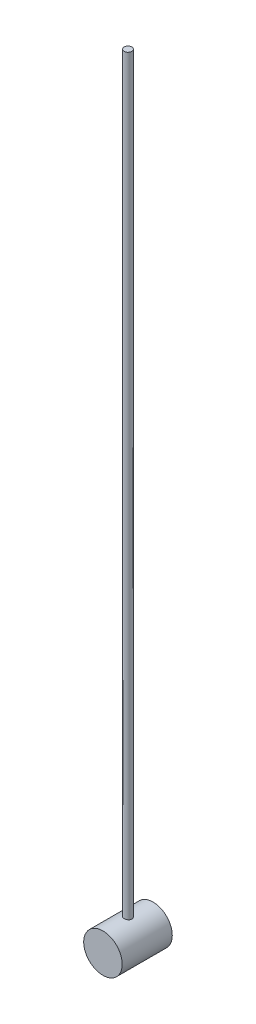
from build123d import *

# Parameters (mm, degrees)
ESQUISSE1_R        = 2.5
BOSS_EXTRU_1_DEPTH = 3.25
ESQUISSE2_R        = 0.5
BOSS_EXTRU_2_DEPTH = 100


with BuildPart() as part:
    # Esquisse1 → Boss.-Extru.1 (new, symmetric)
    with BuildSketch(Plane.XY):
        with Locations(Location((0, 0, 0), (0, 0, 180))):
            Circle(ESQUISSE1_R)
    extrude(amount=BOSS_EXTRU_1_DEPTH, both=True)

    # Esquisse2 → Boss.-Extru.2 (add)
    with BuildSketch(Plane(origin=(0, 0, 0), x_dir=(1, 0, 0), z_dir=(0, 1, 0))):
        with Locations(Location((0, 0, 0), (0, 0, 90))):
            Circle(ESQUISSE2_R)
    extrude(amount=BOSS_EXTRU_2_DEPTH)


solid = part.part
